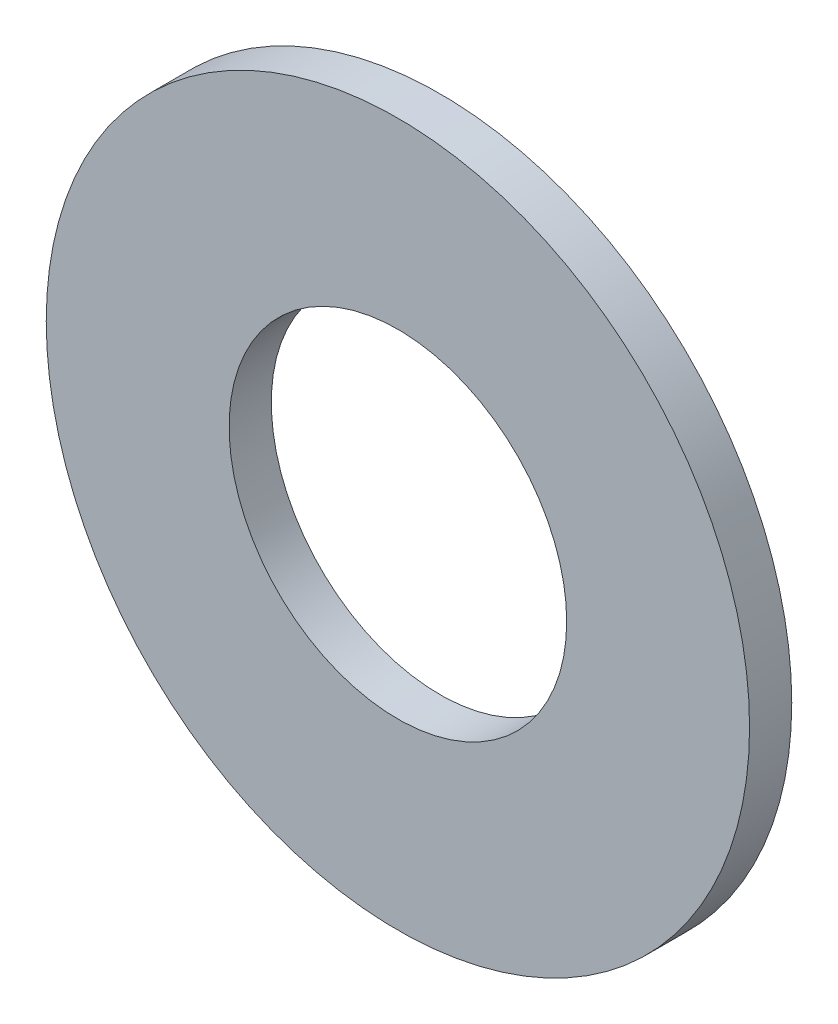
ISO-10303-21;
HEADER;
FILE_DESCRIPTION(('STEP AP214'),'2;1');
FILE_NAME('part.step','',(''),(''),'','','');
FILE_SCHEMA(('AUTOMOTIVE_DESIGN { 1 0 10303 214 1 1 1 1 }'));
ENDSEC;
DATA;
#1=APPLICATION_CONTEXT('core data for automotive mechanical design processes');
#2=APPLICATION_PROTOCOL_DEFINITION('international standard','automotive_design',2000,#1);
#3=PRODUCT_CONTEXT('',#1,'mechanical');
#4=PRODUCT('Part','Part','',(#3));
#5=PRODUCT_RELATED_PRODUCT_CATEGORY('part','',(#4));
#6=PRODUCT_DEFINITION_FORMATION('','',#4);
#7=PRODUCT_DEFINITION_CONTEXT('part definition',#1,'design');
#8=PRODUCT_DEFINITION('design','',#6,#7);
#9=PRODUCT_DEFINITION_SHAPE('','',#8);
#10=(LENGTH_UNIT() NAMED_UNIT(*) SI_UNIT(.MILLI.,.METRE.));
#11=(NAMED_UNIT(*) PLANE_ANGLE_UNIT() SI_UNIT($,.RADIAN.));
#12=(NAMED_UNIT(*) SI_UNIT($,.STERADIAN.) SOLID_ANGLE_UNIT());
#13=UNCERTAINTY_MEASURE_WITH_UNIT(LENGTH_MEASURE(1.E-05),#10,'distance_accuracy_value','');
#14=(GEOMETRIC_REPRESENTATION_CONTEXT(3) GLOBAL_UNCERTAINTY_ASSIGNED_CONTEXT((#13)) GLOBAL_UNIT_ASSIGNED_CONTEXT((#10,
#11,#12)) REPRESENTATION_CONTEXT('',''));
#15=CARTESIAN_POINT('',(0.,0.,0.));
#16=DIRECTION('',(0.,0.,1.));
#17=DIRECTION('',(1.,0.,0.));
#18=AXIS2_PLACEMENT_3D('',#15,#16,#17);
#19=CARTESIAN_POINT('',(0.,0.,-2.38125));
#20=DIRECTION('',(0.,0.,1.));
#21=DIRECTION('',(1.,0.,0.));
#22=AXIS2_PLACEMENT_3D('',#19,#20,#21);
#23=CYLINDRICAL_SURFACE('',#22,19.84375);
#24=CARTESIAN_POINT('',(0.,0.,-2.38125));
#25=DIRECTION('',(0.,0.,1.));
#26=DIRECTION('',(1.,0.,0.));
#27=AXIS2_PLACEMENT_3D('',#24,#25,#26);
#28=CIRCLE('',#27,19.84375);
#29=CARTESIAN_POINT('',(19.84375,0.,-2.38125));
#30=VERTEX_POINT('',#29);
#31=EDGE_CURVE('E10',#30,#30,#28,.T.);
#32=CARTESIAN_POINT('',(0.,0.,0.));
#33=DIRECTION('',(0.,0.,1.));
#34=DIRECTION('',(1.,0.,0.));
#35=AXIS2_PLACEMENT_3D('',#32,#33,#34);
#36=CIRCLE('',#35,19.84375);
#37=CARTESIAN_POINT('',(19.84375,0.,0.));
#38=VERTEX_POINT('',#37);
#39=EDGE_CURVE('E40',#38,#38,#36,.T.);
#40=CARTESIAN_POINT('',(19.84375,0.,-2.38125));
#41=CARTESIAN_POINT('',(19.84375,0.,-2.3564453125));
#42=CARTESIAN_POINT('',(19.84375,0.,-2.331640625));
#43=CARTESIAN_POINT('',(19.84375,0.,-2.28203125));
#44=CARTESIAN_POINT('',(19.84375,0.,-2.2572265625));
#45=CARTESIAN_POINT('',(19.84375,0.,-2.2076171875));
#46=CARTESIAN_POINT('',(19.84375,0.,-2.1828125));
#47=CARTESIAN_POINT('',(19.84375,0.,-2.133203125));
#48=CARTESIAN_POINT('',(19.84375,0.,-2.1083984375));
#49=CARTESIAN_POINT('',(19.84375,0.,-2.0587890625));
#50=CARTESIAN_POINT('',(19.84375,0.,-2.033984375));
#51=CARTESIAN_POINT('',(19.84375,0.,-1.984375));
#52=CARTESIAN_POINT('',(19.84375,0.,-1.9595703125));
#53=CARTESIAN_POINT('',(19.84375,0.,-1.9099609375));
#54=CARTESIAN_POINT('',(19.84375,0.,-1.88515625));
#55=CARTESIAN_POINT('',(19.84375,0.,-1.835546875));
#56=CARTESIAN_POINT('',(19.84375,0.,-1.8107421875));
#57=CARTESIAN_POINT('',(19.84375,0.,-1.7611328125));
#58=CARTESIAN_POINT('',(19.84375,0.,-1.736328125));
#59=CARTESIAN_POINT('',(19.84375,0.,-1.68671875));
#60=CARTESIAN_POINT('',(19.84375,0.,-1.6619140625));
#61=CARTESIAN_POINT('',(19.84375,0.,-1.6123046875));
#62=CARTESIAN_POINT('',(19.84375,0.,-1.5875));
#63=CARTESIAN_POINT('',(19.84375,0.,-1.537890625));
#64=CARTESIAN_POINT('',(19.84375,0.,-1.5130859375));
#65=CARTESIAN_POINT('',(19.84375,0.,-1.4634765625));
#66=CARTESIAN_POINT('',(19.84375,0.,-1.438671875));
#67=CARTESIAN_POINT('',(19.84375,0.,-1.3890625));
#68=CARTESIAN_POINT('',(19.84375,0.,-1.3642578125));
#69=CARTESIAN_POINT('',(19.84375,0.,-1.3146484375));
#70=CARTESIAN_POINT('',(19.84375,0.,-1.28984375));
#71=CARTESIAN_POINT('',(19.84375,0.,-1.240234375));
#72=CARTESIAN_POINT('',(19.84375,0.,-1.2154296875));
#73=CARTESIAN_POINT('',(19.84375,0.,-1.1658203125));
#74=CARTESIAN_POINT('',(19.84375,0.,-1.141015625));
#75=CARTESIAN_POINT('',(19.84375,0.,-1.09140625));
#76=CARTESIAN_POINT('',(19.84375,0.,-1.0666015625));
#77=CARTESIAN_POINT('',(19.84375,0.,-1.0169921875));
#78=CARTESIAN_POINT('',(19.84375,0.,-0.992187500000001));
#79=CARTESIAN_POINT('',(19.84375,0.,-0.942578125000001));
#80=CARTESIAN_POINT('',(19.84375,0.,-0.917773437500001));
#81=CARTESIAN_POINT('',(19.84375,0.,-0.868164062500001));
#82=CARTESIAN_POINT('',(19.84375,0.,-0.843359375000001));
#83=CARTESIAN_POINT('',(19.84375,0.,-0.793750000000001));
#84=CARTESIAN_POINT('',(19.84375,0.,-0.768945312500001));
#85=CARTESIAN_POINT('',(19.84375,0.,-0.719335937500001));
#86=CARTESIAN_POINT('',(19.84375,0.,-0.694531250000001));
#87=CARTESIAN_POINT('',(19.84375,0.,-0.644921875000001));
#88=CARTESIAN_POINT('',(19.84375,0.,-0.620117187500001));
#89=CARTESIAN_POINT('',(19.84375,0.,-0.570507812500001));
#90=CARTESIAN_POINT('',(19.84375,0.,-0.545703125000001));
#91=CARTESIAN_POINT('',(19.84375,0.,-0.496093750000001));
#92=CARTESIAN_POINT('',(19.84375,0.,-0.471289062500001));
#93=CARTESIAN_POINT('',(19.84375,0.,-0.421679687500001));
#94=CARTESIAN_POINT('',(19.84375,0.,-0.396875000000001));
#95=CARTESIAN_POINT('',(19.84375,0.,-0.347265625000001));
#96=CARTESIAN_POINT('',(19.84375,0.,-0.322460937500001));
#97=CARTESIAN_POINT('',(19.84375,0.,-0.272851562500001));
#98=CARTESIAN_POINT('',(19.84375,0.,-0.248046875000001));
#99=CARTESIAN_POINT('',(19.84375,0.,-0.198437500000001));
#100=CARTESIAN_POINT('',(19.84375,0.,-0.173632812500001));
#101=CARTESIAN_POINT('',(19.84375,0.,-0.124023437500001));
#102=CARTESIAN_POINT('',(19.84375,0.,-0.0992187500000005));
#103=CARTESIAN_POINT('',(19.84375,0.,-0.0496093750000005));
#104=CARTESIAN_POINT('',(19.84375,0.,-0.0248046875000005));
#105=CARTESIAN_POINT('',(19.84375,0.,0.));
#106=B_SPLINE_CURVE_WITH_KNOTS('',3,(#40,#41,#42,#43,#44,#45,#46,#47,#48,#49,#50,#51,#52,#53,
#54,#55,#56,#57,#58,#59,#60,#61,#62,#63,#64,#65,#66,#67,#68,#69,#70,#71,#72,#73,#74,#75,#76,#77,
#78,#79,#80,#81,#82,#83,#84,#85,#86,#87,#88,#89,#90,#91,#92,#93,#94,#95,#96,#97,#98,#99,#100,
#101,#102,#103,#104,#105),.UNSPECIFIED.,.F.,.F.,(4,2,2,2,2,2,2,2,2,2,2,2,2,2,2,2,2,2,2,2,2,2,2,
2,2,2,2,2,2,2,2,2,4),(0.,0.0744140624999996,0.148828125,0.2232421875,0.29765625,0.3720703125,
0.446484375,0.5208984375,0.5953125,0.6697265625,0.744140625,0.8185546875,0.89296875,
0.9673828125,1.041796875,1.1162109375,1.190625,1.2650390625,1.339453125,1.4138671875,1.48828125,
1.5626953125,1.637109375,1.7115234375,1.7859375,1.8603515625,1.934765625,2.0091796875,
2.08359375,2.1580078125,2.232421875,2.3068359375,2.38125),.UNSPECIFIED.);
#107=EDGE_CURVE('BSEAM34',#30,#38,#106,.T.);
#108=ORIENTED_EDGE('',*,*,#31,.T.);
#109=ORIENTED_EDGE('',*,*,#39,.F.);
#110=ORIENTED_EDGE('',*,*,#107,.T.);
#111=ORIENTED_EDGE('',*,*,#107,.F.);
#112=EDGE_LOOP('',(#108,#110,#109,#111));
#113=FACE_BOUND('',#112,.T.);
#114=ADVANCED_FACE('F34',(#113),#23,.T.);
#115=CARTESIAN_POINT('',(0.,0.,-2.38125));
#116=DIRECTION('',(0.,0.,1.));
#117=DIRECTION('',(1.,0.,0.));
#118=AXIS2_PLACEMENT_3D('',#115,#116,#117);
#119=PLANE('',#118);
#120=CARTESIAN_POINT('',(0.,0.,-2.38125));
#121=DIRECTION('',(0.,0.,1.));
#122=DIRECTION('',(1.,0.,0.));
#123=AXIS2_PLACEMENT_3D('',#120,#121,#122);
#124=CIRCLE('',#123,9.525);
#125=CARTESIAN_POINT('',(9.525,0.,-2.38125));
#126=VERTEX_POINT('',#125);
#127=EDGE_CURVE('E44',#126,#126,#124,.T.);
#128=ORIENTED_EDGE('',*,*,#127,.T.);
#129=EDGE_LOOP('',(#128));
#130=FACE_BOUND('',#129,.T.);
#131=ORIENTED_EDGE('',*,*,#31,.F.);
#132=EDGE_LOOP('',(#131));
#133=FACE_BOUND('',#132,.T.);
#134=ADVANCED_FACE('F58',(#130,#133),#119,.F.);
#135=CARTESIAN_POINT('',(0.,0.,0.));
#136=DIRECTION('',(0.,0.,1.));
#137=DIRECTION('',(1.,0.,0.));
#138=AXIS2_PLACEMENT_3D('',#135,#136,#137);
#139=PLANE('',#138);
#140=CARTESIAN_POINT('',(0.,0.,0.));
#141=DIRECTION('',(0.,0.,1.));
#142=DIRECTION('',(1.,0.,0.));
#143=AXIS2_PLACEMENT_3D('',#140,#141,#142);
#144=CIRCLE('',#143,9.525);
#145=CARTESIAN_POINT('',(9.525,0.,0.));
#146=VERTEX_POINT('',#145);
#147=EDGE_CURVE('E48',#146,#146,#144,.T.);
#148=ORIENTED_EDGE('',*,*,#147,.F.);
#149=EDGE_LOOP('',(#148));
#150=FACE_BOUND('',#149,.T.);
#151=ORIENTED_EDGE('',*,*,#39,.T.);
#152=EDGE_LOOP('',(#151));
#153=FACE_BOUND('',#152,.T.);
#154=ADVANCED_FACE('F56',(#150,#153),#139,.T.);
#155=CARTESIAN_POINT('',(0.,0.,-2.38125));
#156=DIRECTION('',(0.,0.,1.));
#157=DIRECTION('',(1.,0.,0.));
#158=AXIS2_PLACEMENT_3D('',#155,#156,#157);
#159=CYLINDRICAL_SURFACE('',#158,9.525);
#160=CARTESIAN_POINT('',(9.525,0.,-2.38125));
#161=CARTESIAN_POINT('',(9.525,0.,-2.3564453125));
#162=CARTESIAN_POINT('',(9.525,0.,-2.331640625));
#163=CARTESIAN_POINT('',(9.525,0.,-2.28203125));
#164=CARTESIAN_POINT('',(9.525,0.,-2.2572265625));
#165=CARTESIAN_POINT('',(9.525,0.,-2.2076171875));
#166=CARTESIAN_POINT('',(9.525,0.,-2.1828125));
#167=CARTESIAN_POINT('',(9.525,0.,-2.133203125));
#168=CARTESIAN_POINT('',(9.525,0.,-2.1083984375));
#169=CARTESIAN_POINT('',(9.525,0.,-2.0587890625));
#170=CARTESIAN_POINT('',(9.525,0.,-2.033984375));
#171=CARTESIAN_POINT('',(9.525,0.,-1.984375));
#172=CARTESIAN_POINT('',(9.525,0.,-1.9595703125));
#173=CARTESIAN_POINT('',(9.525,0.,-1.9099609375));
#174=CARTESIAN_POINT('',(9.525,0.,-1.88515625));
#175=CARTESIAN_POINT('',(9.525,0.,-1.835546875));
#176=CARTESIAN_POINT('',(9.525,0.,-1.8107421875));
#177=CARTESIAN_POINT('',(9.525,0.,-1.7611328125));
#178=CARTESIAN_POINT('',(9.525,0.,-1.736328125));
#179=CARTESIAN_POINT('',(9.525,0.,-1.68671875));
#180=CARTESIAN_POINT('',(9.525,0.,-1.6619140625));
#181=CARTESIAN_POINT('',(9.525,0.,-1.6123046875));
#182=CARTESIAN_POINT('',(9.525,0.,-1.5875));
#183=CARTESIAN_POINT('',(9.525,0.,-1.537890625));
#184=CARTESIAN_POINT('',(9.525,0.,-1.5130859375));
#185=CARTESIAN_POINT('',(9.525,0.,-1.4634765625));
#186=CARTESIAN_POINT('',(9.525,0.,-1.438671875));
#187=CARTESIAN_POINT('',(9.525,0.,-1.3890625));
#188=CARTESIAN_POINT('',(9.525,0.,-1.3642578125));
#189=CARTESIAN_POINT('',(9.525,0.,-1.3146484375));
#190=CARTESIAN_POINT('',(9.525,0.,-1.28984375));
#191=CARTESIAN_POINT('',(9.525,0.,-1.240234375));
#192=CARTESIAN_POINT('',(9.525,0.,-1.2154296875));
#193=CARTESIAN_POINT('',(9.525,0.,-1.1658203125));
#194=CARTESIAN_POINT('',(9.525,0.,-1.141015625));
#195=CARTESIAN_POINT('',(9.525,0.,-1.09140625));
#196=CARTESIAN_POINT('',(9.525,0.,-1.0666015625));
#197=CARTESIAN_POINT('',(9.525,0.,-1.0169921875));
#198=CARTESIAN_POINT('',(9.525,0.,-0.992187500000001));
#199=CARTESIAN_POINT('',(9.525,0.,-0.942578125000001));
#200=CARTESIAN_POINT('',(9.525,0.,-0.917773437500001));
#201=CARTESIAN_POINT('',(9.525,0.,-0.868164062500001));
#202=CARTESIAN_POINT('',(9.525,0.,-0.843359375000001));
#203=CARTESIAN_POINT('',(9.525,0.,-0.793750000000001));
#204=CARTESIAN_POINT('',(9.525,0.,-0.768945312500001));
#205=CARTESIAN_POINT('',(9.525,0.,-0.719335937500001));
#206=CARTESIAN_POINT('',(9.525,0.,-0.694531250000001));
#207=CARTESIAN_POINT('',(9.525,0.,-0.644921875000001));
#208=CARTESIAN_POINT('',(9.525,0.,-0.620117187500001));
#209=CARTESIAN_POINT('',(9.525,0.,-0.570507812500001));
#210=CARTESIAN_POINT('',(9.525,0.,-0.545703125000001));
#211=CARTESIAN_POINT('',(9.525,0.,-0.496093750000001));
#212=CARTESIAN_POINT('',(9.525,0.,-0.471289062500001));
#213=CARTESIAN_POINT('',(9.525,0.,-0.421679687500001));
#214=CARTESIAN_POINT('',(9.525,0.,-0.396875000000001));
#215=CARTESIAN_POINT('',(9.525,0.,-0.347265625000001));
#216=CARTESIAN_POINT('',(9.525,0.,-0.322460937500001));
#217=CARTESIAN_POINT('',(9.525,0.,-0.272851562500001));
#218=CARTESIAN_POINT('',(9.525,0.,-0.248046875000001));
#219=CARTESIAN_POINT('',(9.525,0.,-0.198437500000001));
#220=CARTESIAN_POINT('',(9.525,0.,-0.173632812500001));
#221=CARTESIAN_POINT('',(9.525,0.,-0.124023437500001));
#222=CARTESIAN_POINT('',(9.525,0.,-0.0992187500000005));
#223=CARTESIAN_POINT('',(9.525,0.,-0.0496093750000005));
#224=CARTESIAN_POINT('',(9.525,0.,-0.0248046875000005));
#225=CARTESIAN_POINT('',(9.525,0.,0.));
#226=B_SPLINE_CURVE_WITH_KNOTS('',3,(#160,#161,#162,#163,#164,#165,#166,#167,#168,#169,#170,
#171,#172,#173,#174,#175,#176,#177,#178,#179,#180,#181,#182,#183,#184,#185,#186,#187,#188,#189,
#190,#191,#192,#193,#194,#195,#196,#197,#198,#199,#200,#201,#202,#203,#204,#205,#206,#207,#208,
#209,#210,#211,#212,#213,#214,#215,#216,#217,#218,#219,#220,#221,#222,#223,#224,#225),
.UNSPECIFIED.,.F.,.F.,(4,2,2,2,2,2,2,2,2,2,2,2,2,2,2,2,2,2,2,2,2,2,2,2,2,2,2,2,2,2,2,2,4),(0.,
0.0744140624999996,0.148828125,0.2232421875,0.29765625,0.3720703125,0.446484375,0.5208984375,
0.5953125,0.6697265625,0.744140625,0.8185546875,0.89296875,0.9673828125,1.041796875,
1.1162109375,1.190625,1.2650390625,1.339453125,1.4138671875,1.48828125,1.5626953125,1.637109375,
1.7115234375,1.7859375,1.8603515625,1.934765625,2.0091796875,2.08359375,2.1580078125,
2.232421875,2.3068359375,2.38125),.UNSPECIFIED.);
#227=EDGE_CURVE('BSEAM54',#126,#146,#226,.T.);
#228=ORIENTED_EDGE('',*,*,#127,.F.);
#229=ORIENTED_EDGE('',*,*,#147,.T.);
#230=ORIENTED_EDGE('',*,*,#227,.T.);
#231=ORIENTED_EDGE('',*,*,#227,.F.);
#232=EDGE_LOOP('',(#228,#230,#229,#231));
#233=FACE_BOUND('',#232,.T.);
#234=ADVANCED_FACE('F54',(#233),#159,.F.);
#235=CLOSED_SHELL('',(#114,#134,#154,#234));
#236=MANIFOLD_SOLID_BREP('B2',#235);
#237=ADVANCED_BREP_SHAPE_REPRESENTATION('',(#18,#236),#14);
#238=SHAPE_DEFINITION_REPRESENTATION(#9,#237);
ENDSEC;
END-ISO-10303-21;
